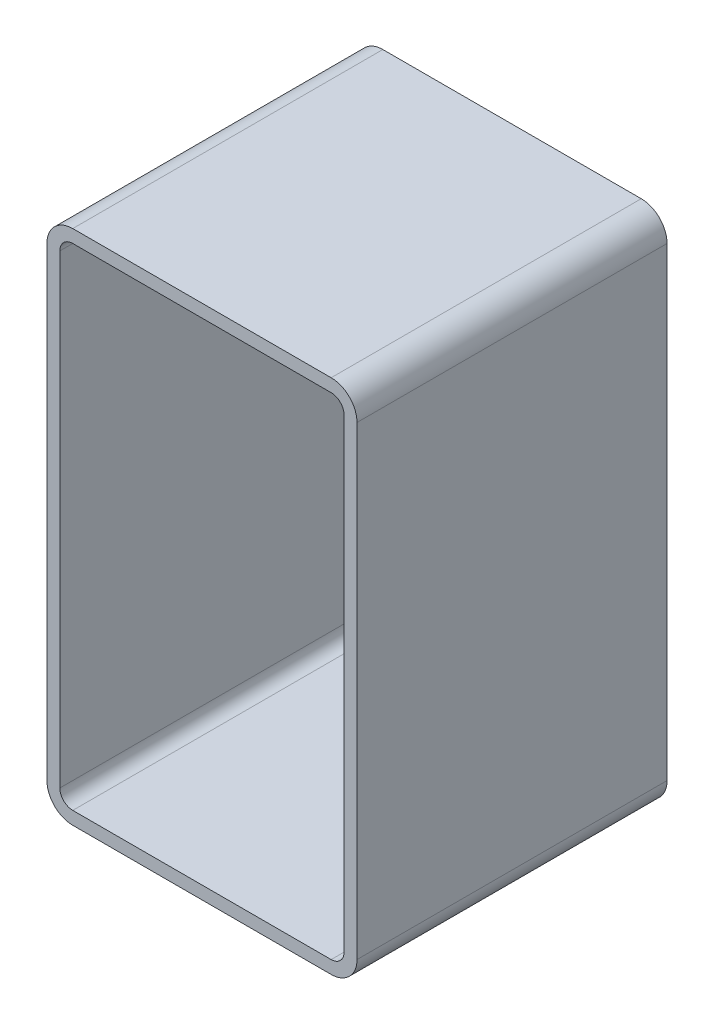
ISO-10303-21;
HEADER;
FILE_DESCRIPTION(('STEP AP214'),'2;1');
FILE_NAME('part.step','',(''),(''),'','','');
FILE_SCHEMA(('AUTOMOTIVE_DESIGN { 1 0 10303 214 1 1 1 1 }'));
ENDSEC;
DATA;
#1=APPLICATION_CONTEXT('core data for automotive mechanical design processes');
#2=APPLICATION_PROTOCOL_DEFINITION('international standard','automotive_design',2000,#1);
#3=PRODUCT_CONTEXT('',#1,'mechanical');
#4=PRODUCT('Part','Part','',(#3));
#5=PRODUCT_RELATED_PRODUCT_CATEGORY('part','',(#4));
#6=PRODUCT_DEFINITION_FORMATION('','',#4);
#7=PRODUCT_DEFINITION_CONTEXT('part definition',#1,'design');
#8=PRODUCT_DEFINITION('design','',#6,#7);
#9=PRODUCT_DEFINITION_SHAPE('','',#8);
#10=(LENGTH_UNIT() NAMED_UNIT(*) SI_UNIT(.MILLI.,.METRE.));
#11=(NAMED_UNIT(*) PLANE_ANGLE_UNIT() SI_UNIT($,.RADIAN.));
#12=(NAMED_UNIT(*) SI_UNIT($,.STERADIAN.) SOLID_ANGLE_UNIT());
#13=UNCERTAINTY_MEASURE_WITH_UNIT(LENGTH_MEASURE(1.E-05),#10,'distance_accuracy_value','');
#14=(GEOMETRIC_REPRESENTATION_CONTEXT(3) GLOBAL_UNCERTAINTY_ASSIGNED_CONTEXT((#13)) GLOBAL_UNIT_ASSIGNED_CONTEXT((#10,
#11,#12)) REPRESENTATION_CONTEXT('',''));
#15=CARTESIAN_POINT('',(0.,0.,0.));
#16=DIRECTION('',(0.,0.,1.));
#17=DIRECTION('',(1.,0.,0.));
#18=AXIS2_PLACEMENT_3D('',#15,#16,#17);
#19=CARTESIAN_POINT('',(280.50670300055,27.0912282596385,304.8));
#20=DIRECTION('',(0.,0.,1.));
#21=DIRECTION('',(1.,0.,0.));
#22=AXIS2_PLACEMENT_3D('',#19,#20,#21);
#23=PLANE('',#22);
#24=CARTESIAN_POINT('',(280.50670300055,27.0912282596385,304.8));
#25=DIRECTION('',(0.,0.,1.));
#26=DIRECTION('',(1.,0.,0.));
#27=AXIS2_PLACEMENT_3D('',#24,#25,#26);
#28=CIRCLE('',#27,25.4);
#29=CARTESIAN_POINT('',(280.50670300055,1.6912282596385,304.8));
#30=VERTEX_POINT('',#29);
#31=CARTESIAN_POINT('',(305.90670300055,27.0912282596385,304.8));
#32=VERTEX_POINT('',#31);
#33=EDGE_CURVE('E211',#30,#32,#28,.T.);
#34=ORIENTED_EDGE('',*,*,#33,.T.);
#35=DIRECTION('',(0.,1.,0.));
#36=VECTOR('',#35,1.);
#37=CARTESIAN_POINT('',(305.90670300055,484.291228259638,304.8));
#38=LINE('',#37,#36);
#39=CARTESIAN_POINT('',(305.90670300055,484.291228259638,304.8));
#40=VERTEX_POINT('',#39);
#41=EDGE_CURVE('E214',#32,#40,#38,.T.);
#42=ORIENTED_EDGE('',*,*,#41,.T.);
#43=CARTESIAN_POINT('',(280.50670300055,484.291228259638,304.8));
#44=DIRECTION('',(0.,0.,1.));
#45=DIRECTION('',(1.,0.,0.));
#46=AXIS2_PLACEMENT_3D('',#43,#44,#45);
#47=CIRCLE('',#46,25.4);
#48=CARTESIAN_POINT('',(280.50670300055,509.691228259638,304.8));
#49=VERTEX_POINT('',#48);
#50=EDGE_CURVE('E217',#40,#49,#47,.T.);
#51=ORIENTED_EDGE('',*,*,#50,.T.);
#52=DIRECTION('',(-1.,0.,0.));
#53=VECTOR('',#52,1.);
#54=CARTESIAN_POINT('',(26.5067030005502,509.691228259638,304.8));
#55=LINE('',#54,#53);
#56=CARTESIAN_POINT('',(26.5067030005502,509.691228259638,304.8));
#57=VERTEX_POINT('',#56);
#58=EDGE_CURVE('E219',#49,#57,#55,.T.);
#59=ORIENTED_EDGE('',*,*,#58,.T.);
#60=CARTESIAN_POINT('',(26.5067030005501,484.291228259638,304.8));
#61=DIRECTION('',(0.,0.,1.));
#62=DIRECTION('',(1.,0.,0.));
#63=AXIS2_PLACEMENT_3D('',#60,#61,#62);
#64=CIRCLE('',#63,25.4);
#65=CARTESIAN_POINT('',(1.10670300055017,484.291228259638,304.8));
#66=VERTEX_POINT('',#65);
#67=EDGE_CURVE('E221',#57,#66,#64,.T.);
#68=ORIENTED_EDGE('',*,*,#67,.T.);
#69=DIRECTION('',(0.,-1.,0.));
#70=VECTOR('',#69,1.);
#71=CARTESIAN_POINT('',(1.10670300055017,27.0912282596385,304.8));
#72=LINE('',#71,#70);
#73=CARTESIAN_POINT('',(1.10670300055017,27.0912282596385,304.8));
#74=VERTEX_POINT('',#73);
#75=EDGE_CURVE('E223',#66,#74,#72,.T.);
#76=ORIENTED_EDGE('',*,*,#75,.T.);
#77=CARTESIAN_POINT('',(26.5067030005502,27.0912282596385,304.8));
#78=DIRECTION('',(0.,0.,1.));
#79=DIRECTION('',(1.,0.,0.));
#80=AXIS2_PLACEMENT_3D('',#77,#78,#79);
#81=CIRCLE('',#80,25.4);
#82=CARTESIAN_POINT('',(26.5067030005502,1.6912282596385,304.8));
#83=VERTEX_POINT('',#82);
#84=EDGE_CURVE('E225',#74,#83,#81,.T.);
#85=ORIENTED_EDGE('',*,*,#84,.T.);
#86=DIRECTION('',(1.,0.,0.));
#87=VECTOR('',#86,1.);
#88=CARTESIAN_POINT('',(280.50670300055,1.6912282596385,304.8));
#89=LINE('',#88,#87);
#90=EDGE_CURVE('E227',#83,#30,#89,.T.);
#91=ORIENTED_EDGE('',*,*,#90,.T.);
#92=EDGE_LOOP('',(#34,#42,#51,#59,#68,#76,#85,#91));
#93=FACE_BOUND('',#92,.T.);
#94=DIRECTION('',(0.,-1.,0.));
#95=VECTOR('',#94,1.);
#96=CARTESIAN_POINT('',(13.8067030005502,27.0912282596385,304.8));
#97=LINE('',#96,#95);
#98=CARTESIAN_POINT('',(13.8067030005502,484.291228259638,304.8));
#99=VERTEX_POINT('',#98);
#100=CARTESIAN_POINT('',(13.8067030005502,27.0912282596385,304.8));
#101=VERTEX_POINT('',#100);
#102=EDGE_CURVE('E154',#99,#101,#97,.T.);
#103=ORIENTED_EDGE('',*,*,#102,.F.);
#104=CARTESIAN_POINT('',(26.5067030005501,484.291228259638,304.8));
#105=DIRECTION('',(0.,0.,1.));
#106=DIRECTION('',(1.,0.,0.));
#107=AXIS2_PLACEMENT_3D('',#104,#105,#106);
#108=CIRCLE('',#107,12.7);
#109=CARTESIAN_POINT('',(26.5067030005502,496.991228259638,304.8));
#110=VERTEX_POINT('',#109);
#111=EDGE_CURVE('E146',#110,#99,#108,.T.);
#112=ORIENTED_EDGE('',*,*,#111,.F.);
#113=DIRECTION('',(-1.,0.,0.));
#114=VECTOR('',#113,1.);
#115=CARTESIAN_POINT('',(26.5067030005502,496.991228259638,304.8));
#116=LINE('',#115,#114);
#117=CARTESIAN_POINT('',(280.50670300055,496.991228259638,304.8));
#118=VERTEX_POINT('',#117);
#119=EDGE_CURVE('E179',#118,#110,#116,.T.);
#120=ORIENTED_EDGE('',*,*,#119,.F.);
#121=CARTESIAN_POINT('',(280.50670300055,484.291228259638,304.8));
#122=DIRECTION('',(0.,0.,1.));
#123=DIRECTION('',(1.,0.,0.));
#124=AXIS2_PLACEMENT_3D('',#121,#122,#123);
#125=CIRCLE('',#124,12.7);
#126=CARTESIAN_POINT('',(293.20670300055,484.291228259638,304.8));
#127=VERTEX_POINT('',#126);
#128=EDGE_CURVE('E177',#127,#118,#125,.T.);
#129=ORIENTED_EDGE('',*,*,#128,.F.);
#130=DIRECTION('',(0.,1.,0.));
#131=VECTOR('',#130,1.);
#132=CARTESIAN_POINT('',(293.20670300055,484.291228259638,304.8));
#133=LINE('',#132,#131);
#134=CARTESIAN_POINT('',(293.20670300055,27.0912282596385,304.8));
#135=VERTEX_POINT('',#134);
#136=EDGE_CURVE('E175',#135,#127,#133,.T.);
#137=ORIENTED_EDGE('',*,*,#136,.F.);
#138=CARTESIAN_POINT('',(280.50670300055,27.0912282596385,304.8));
#139=DIRECTION('',(0.,0.,1.));
#140=DIRECTION('',(1.,0.,0.));
#141=AXIS2_PLACEMENT_3D('',#138,#139,#140);
#142=CIRCLE('',#141,12.7);
#143=CARTESIAN_POINT('',(280.50670300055,14.3912282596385,304.8));
#144=VERTEX_POINT('',#143);
#145=EDGE_CURVE('E173',#144,#135,#142,.T.);
#146=ORIENTED_EDGE('',*,*,#145,.F.);
#147=DIRECTION('',(1.,0.,0.));
#148=VECTOR('',#147,1.);
#149=CARTESIAN_POINT('',(280.50670300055,14.3912282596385,304.8));
#150=LINE('',#149,#148);
#151=CARTESIAN_POINT('',(26.5067030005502,14.3912282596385,304.8));
#152=VERTEX_POINT('',#151);
#153=EDGE_CURVE('E169',#152,#144,#150,.T.);
#154=ORIENTED_EDGE('',*,*,#153,.F.);
#155=CARTESIAN_POINT('',(26.5067030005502,27.0912282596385,304.8));
#156=DIRECTION('',(0.,0.,1.));
#157=DIRECTION('',(1.,0.,0.));
#158=AXIS2_PLACEMENT_3D('',#155,#156,#157);
#159=CIRCLE('',#158,12.7);
#160=EDGE_CURVE('E167',#101,#152,#159,.T.);
#161=ORIENTED_EDGE('',*,*,#160,.F.);
#162=EDGE_LOOP('',(#103,#112,#120,#129,#137,#146,#154,#161));
#163=FACE_BOUND('',#162,.T.);
#164=ADVANCED_FACE('F33',(#93,#163),#23,.T.);
#165=CARTESIAN_POINT('',(280.50670300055,27.0912282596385,0.));
#166=DIRECTION('',(0.,0.,1.));
#167=DIRECTION('',(1.,0.,0.));
#168=AXIS2_PLACEMENT_3D('',#165,#166,#167);
#169=PLANE('',#168);
#170=CARTESIAN_POINT('',(280.50670300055,27.0912282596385,0.));
#171=DIRECTION('',(0.,0.,1.));
#172=DIRECTION('',(1.,0.,0.));
#173=AXIS2_PLACEMENT_3D('',#170,#171,#172);
#174=CIRCLE('',#173,25.4);
#175=CARTESIAN_POINT('',(280.50670300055,1.6912282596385,0.));
#176=VERTEX_POINT('',#175);
#177=CARTESIAN_POINT('',(305.90670300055,27.0912282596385,0.));
#178=VERTEX_POINT('',#177);
#179=EDGE_CURVE('E162',#176,#178,#174,.T.);
#180=ORIENTED_EDGE('',*,*,#179,.F.);
#181=DIRECTION('',(1.,0.,0.));
#182=VECTOR('',#181,1.);
#183=CARTESIAN_POINT('',(280.50670300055,1.6912282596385,0.));
#184=LINE('',#183,#182);
#185=CARTESIAN_POINT('',(26.5067030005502,1.6912282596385,0.));
#186=VERTEX_POINT('',#185);
#187=EDGE_CURVE('E215',#186,#176,#184,.T.);
#188=ORIENTED_EDGE('',*,*,#187,.F.);
#189=CARTESIAN_POINT('',(26.5067030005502,27.0912282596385,0.));
#190=DIRECTION('',(0.,0.,1.));
#191=DIRECTION('',(1.,0.,0.));
#192=AXIS2_PLACEMENT_3D('',#189,#190,#191);
#193=CIRCLE('',#192,25.4);
#194=CARTESIAN_POINT('',(1.10670300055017,27.0912282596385,0.));
#195=VERTEX_POINT('',#194);
#196=EDGE_CURVE('E242',#195,#186,#193,.T.);
#197=ORIENTED_EDGE('',*,*,#196,.F.);
#198=DIRECTION('',(0.,-1.,0.));
#199=VECTOR('',#198,1.);
#200=CARTESIAN_POINT('',(1.10670300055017,27.0912282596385,0.));
#201=LINE('',#200,#199);
#202=CARTESIAN_POINT('',(1.10670300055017,484.291228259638,0.));
#203=VERTEX_POINT('',#202);
#204=EDGE_CURVE('E240',#203,#195,#201,.T.);
#205=ORIENTED_EDGE('',*,*,#204,.F.);
#206=CARTESIAN_POINT('',(26.5067030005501,484.291228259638,0.));
#207=DIRECTION('',(0.,0.,1.));
#208=DIRECTION('',(1.,0.,0.));
#209=AXIS2_PLACEMENT_3D('',#206,#207,#208);
#210=CIRCLE('',#209,25.4);
#211=CARTESIAN_POINT('',(26.5067030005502,509.691228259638,0.));
#212=VERTEX_POINT('',#211);
#213=EDGE_CURVE('E238',#212,#203,#210,.T.);
#214=ORIENTED_EDGE('',*,*,#213,.F.);
#215=DIRECTION('',(-1.,0.,0.));
#216=VECTOR('',#215,1.);
#217=CARTESIAN_POINT('',(26.5067030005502,509.691228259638,0.));
#218=LINE('',#217,#216);
#219=CARTESIAN_POINT('',(280.50670300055,509.691228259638,0.));
#220=VERTEX_POINT('',#219);
#221=EDGE_CURVE('E236',#220,#212,#218,.T.);
#222=ORIENTED_EDGE('',*,*,#221,.F.);
#223=CARTESIAN_POINT('',(280.50670300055,484.291228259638,0.));
#224=DIRECTION('',(0.,0.,1.));
#225=DIRECTION('',(1.,0.,0.));
#226=AXIS2_PLACEMENT_3D('',#223,#224,#225);
#227=CIRCLE('',#226,25.4);
#228=CARTESIAN_POINT('',(305.90670300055,484.291228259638,0.));
#229=VERTEX_POINT('',#228);
#230=EDGE_CURVE('E234',#229,#220,#227,.T.);
#231=ORIENTED_EDGE('',*,*,#230,.F.);
#232=DIRECTION('',(0.,1.,0.));
#233=VECTOR('',#232,1.);
#234=CARTESIAN_POINT('',(305.90670300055,484.291228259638,0.));
#235=LINE('',#234,#233);
#236=EDGE_CURVE('E232',#178,#229,#235,.T.);
#237=ORIENTED_EDGE('',*,*,#236,.F.);
#238=EDGE_LOOP('',(#180,#188,#197,#205,#214,#222,#231,#237));
#239=FACE_BOUND('',#238,.T.);
#240=CARTESIAN_POINT('',(26.5067030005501,484.291228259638,0.));
#241=DIRECTION('',(0.,0.,1.));
#242=DIRECTION('',(1.,0.,0.));
#243=AXIS2_PLACEMENT_3D('',#240,#241,#242);
#244=CIRCLE('',#243,12.7);
#245=CARTESIAN_POINT('',(26.5067030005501,496.991228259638,0.));
#246=VERTEX_POINT('',#245);
#247=CARTESIAN_POINT('',(13.8067030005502,484.291228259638,0.));
#248=VERTEX_POINT('',#247);
#249=EDGE_CURVE('E56',#246,#248,#244,.T.);
#250=ORIENTED_EDGE('',*,*,#249,.T.);
#251=DIRECTION('',(0.,-1.,0.));
#252=VECTOR('',#251,1.);
#253=CARTESIAN_POINT('',(13.8067030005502,27.0912282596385,0.));
#254=LINE('',#253,#252);
#255=CARTESIAN_POINT('',(13.8067030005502,27.0912282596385,0.));
#256=VERTEX_POINT('',#255);
#257=EDGE_CURVE('E161',#248,#256,#254,.T.);
#258=ORIENTED_EDGE('',*,*,#257,.T.);
#259=CARTESIAN_POINT('',(26.5067030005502,27.0912282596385,0.));
#260=DIRECTION('',(0.,0.,1.));
#261=DIRECTION('',(1.,0.,0.));
#262=AXIS2_PLACEMENT_3D('',#259,#260,#261);
#263=CIRCLE('',#262,12.7);
#264=CARTESIAN_POINT('',(26.5067030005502,14.3912282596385,0.));
#265=VERTEX_POINT('',#264);
#266=EDGE_CURVE('E183',#256,#265,#263,.T.);
#267=ORIENTED_EDGE('',*,*,#266,.T.);
#268=DIRECTION('',(1.,0.,0.));
#269=VECTOR('',#268,1.);
#270=CARTESIAN_POINT('',(280.50670300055,14.3912282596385,0.));
#271=LINE('',#270,#269);
#272=CARTESIAN_POINT('',(280.50670300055,14.3912282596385,0.));
#273=VERTEX_POINT('',#272);
#274=EDGE_CURVE('E186',#265,#273,#271,.T.);
#275=ORIENTED_EDGE('',*,*,#274,.T.);
#276=CARTESIAN_POINT('',(280.50670300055,27.0912282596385,0.));
#277=DIRECTION('',(0.,0.,1.));
#278=DIRECTION('',(1.,0.,0.));
#279=AXIS2_PLACEMENT_3D('',#276,#277,#278);
#280=CIRCLE('',#279,12.7);
#281=CARTESIAN_POINT('',(293.20670300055,27.0912282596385,0.));
#282=VERTEX_POINT('',#281);
#283=EDGE_CURVE('E189',#273,#282,#280,.T.);
#284=ORIENTED_EDGE('',*,*,#283,.T.);
#285=DIRECTION('',(0.,1.,0.));
#286=VECTOR('',#285,1.);
#287=CARTESIAN_POINT('',(293.20670300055,484.291228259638,0.));
#288=LINE('',#287,#286);
#289=CARTESIAN_POINT('',(293.20670300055,484.291228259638,0.));
#290=VERTEX_POINT('',#289);
#291=EDGE_CURVE('E192',#282,#290,#288,.T.);
#292=ORIENTED_EDGE('',*,*,#291,.T.);
#293=CARTESIAN_POINT('',(280.50670300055,484.291228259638,0.));
#294=DIRECTION('',(0.,0.,1.));
#295=DIRECTION('',(1.,0.,0.));
#296=AXIS2_PLACEMENT_3D('',#293,#294,#295);
#297=CIRCLE('',#296,12.7);
#298=CARTESIAN_POINT('',(280.50670300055,496.991228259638,0.));
#299=VERTEX_POINT('',#298);
#300=EDGE_CURVE('E195',#290,#299,#297,.T.);
#301=ORIENTED_EDGE('',*,*,#300,.T.);
#302=DIRECTION('',(-1.,0.,0.));
#303=VECTOR('',#302,1.);
#304=CARTESIAN_POINT('',(26.5067030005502,496.991228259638,0.));
#305=LINE('',#304,#303);
#306=EDGE_CURVE('E155',#299,#246,#305,.T.);
#307=ORIENTED_EDGE('',*,*,#306,.T.);
#308=EDGE_LOOP('',(#250,#258,#267,#275,#284,#292,#301,#307));
#309=FACE_BOUND('',#308,.T.);
#310=ADVANCED_FACE('F272',(#239,#309),#169,.F.);
#311=CARTESIAN_POINT('',(280.50670300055,27.0912282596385,304.8));
#312=DIRECTION('',(0.,0.,-1.));
#313=DIRECTION('',(-1.,0.,0.));
#314=AXIS2_PLACEMENT_3D('',#311,#312,#313);
#315=CYLINDRICAL_SURFACE('',#314,25.4);
#316=ORIENTED_EDGE('',*,*,#179,.T.);
#317=DIRECTION('',(0.,0.,-1.));
#318=VECTOR('',#317,1.);
#319=CARTESIAN_POINT('',(305.90670300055,27.0912282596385,304.8));
#320=LINE('',#319,#318);
#321=EDGE_CURVE('E11',#32,#178,#320,.T.);
#322=ORIENTED_EDGE('',*,*,#321,.F.);
#323=ORIENTED_EDGE('',*,*,#33,.F.);
#324=DIRECTION('',(0.,0.,-1.));
#325=VECTOR('',#324,1.);
#326=CARTESIAN_POINT('',(280.50670300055,1.6912282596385,304.8));
#327=LINE('',#326,#325);
#328=EDGE_CURVE('E229',#30,#176,#327,.T.);
#329=ORIENTED_EDGE('',*,*,#328,.T.);
#330=EDGE_LOOP('',(#316,#322,#323,#329));
#331=FACE_BOUND('',#330,.T.);
#332=ADVANCED_FACE('F35',(#331),#315,.T.);
#333=CARTESIAN_POINT('',(305.90670300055,484.291228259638,304.8));
#334=DIRECTION('',(-1.,0.,0.));
#335=DIRECTION('',(0.,0.,1.));
#336=AXIS2_PLACEMENT_3D('',#333,#334,#335);
#337=PLANE('',#336);
#338=ORIENTED_EDGE('',*,*,#236,.T.);
#339=DIRECTION('',(0.,0.,-1.));
#340=VECTOR('',#339,1.);
#341=CARTESIAN_POINT('',(305.90670300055,484.291228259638,304.8));
#342=LINE('',#341,#340);
#343=EDGE_CURVE('E41',#40,#229,#342,.T.);
#344=ORIENTED_EDGE('',*,*,#343,.F.);
#345=ORIENTED_EDGE('',*,*,#41,.F.);
#346=ORIENTED_EDGE('',*,*,#321,.T.);
#347=EDGE_LOOP('',(#338,#344,#345,#346));
#348=FACE_BOUND('',#347,.T.);
#349=ADVANCED_FACE('F289',(#348),#337,.F.);
#350=CARTESIAN_POINT('',(280.50670300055,484.291228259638,304.8));
#351=DIRECTION('',(0.,0.,-1.));
#352=DIRECTION('',(-1.,0.,0.));
#353=AXIS2_PLACEMENT_3D('',#350,#351,#352);
#354=CYLINDRICAL_SURFACE('',#353,25.4);
#355=ORIENTED_EDGE('',*,*,#230,.T.);
#356=DIRECTION('',(0.,0.,-1.));
#357=VECTOR('',#356,1.);
#358=CARTESIAN_POINT('',(280.50670300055,509.691228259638,304.8));
#359=LINE('',#358,#357);
#360=EDGE_CURVE('E259',#49,#220,#359,.T.);
#361=ORIENTED_EDGE('',*,*,#360,.F.);
#362=ORIENTED_EDGE('',*,*,#50,.F.);
#363=ORIENTED_EDGE('',*,*,#343,.T.);
#364=EDGE_LOOP('',(#355,#361,#362,#363));
#365=FACE_BOUND('',#364,.T.);
#366=ADVANCED_FACE('F266',(#365),#354,.T.);
#367=CARTESIAN_POINT('',(26.5067030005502,509.691228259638,304.8));
#368=DIRECTION('',(0.,-1.,0.));
#369=DIRECTION('',(0.,0.,-1.));
#370=AXIS2_PLACEMENT_3D('',#367,#368,#369);
#371=PLANE('',#370);
#372=ORIENTED_EDGE('',*,*,#221,.T.);
#373=DIRECTION('',(0.,0.,-1.));
#374=VECTOR('',#373,1.);
#375=CARTESIAN_POINT('',(26.5067030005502,509.691228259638,304.8));
#376=LINE('',#375,#374);
#377=EDGE_CURVE('E256',#57,#212,#376,.T.);
#378=ORIENTED_EDGE('',*,*,#377,.F.);
#379=ORIENTED_EDGE('',*,*,#58,.F.);
#380=ORIENTED_EDGE('',*,*,#360,.T.);
#381=EDGE_LOOP('',(#372,#378,#379,#380));
#382=FACE_BOUND('',#381,.T.);
#383=ADVANCED_FACE('F278',(#382),#371,.F.);
#384=CARTESIAN_POINT('',(26.5067030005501,484.291228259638,304.8));
#385=DIRECTION('',(0.,0.,-1.));
#386=DIRECTION('',(-1.,0.,0.));
#387=AXIS2_PLACEMENT_3D('',#384,#385,#386);
#388=CYLINDRICAL_SURFACE('',#387,25.4);
#389=ORIENTED_EDGE('',*,*,#213,.T.);
#390=DIRECTION('',(0.,0.,-1.));
#391=VECTOR('',#390,1.);
#392=CARTESIAN_POINT('',(1.10670300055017,484.291228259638,304.8));
#393=LINE('',#392,#391);
#394=EDGE_CURVE('E253',#66,#203,#393,.T.);
#395=ORIENTED_EDGE('',*,*,#394,.F.);
#396=ORIENTED_EDGE('',*,*,#67,.F.);
#397=ORIENTED_EDGE('',*,*,#377,.T.);
#398=EDGE_LOOP('',(#389,#395,#396,#397));
#399=FACE_BOUND('',#398,.T.);
#400=ADVANCED_FACE('F282',(#399),#388,.T.);
#401=CARTESIAN_POINT('',(1.10670300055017,27.0912282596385,304.8));
#402=DIRECTION('',(1.,0.,0.));
#403=DIRECTION('',(0.,0.,-1.));
#404=AXIS2_PLACEMENT_3D('',#401,#402,#403);
#405=PLANE('',#404);
#406=ORIENTED_EDGE('',*,*,#204,.T.);
#407=DIRECTION('',(0.,0.,-1.));
#408=VECTOR('',#407,1.);
#409=CARTESIAN_POINT('',(1.10670300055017,27.0912282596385,304.8));
#410=LINE('',#409,#408);
#411=EDGE_CURVE('E250',#74,#195,#410,.T.);
#412=ORIENTED_EDGE('',*,*,#411,.F.);
#413=ORIENTED_EDGE('',*,*,#75,.F.);
#414=ORIENTED_EDGE('',*,*,#394,.T.);
#415=EDGE_LOOP('',(#406,#412,#413,#414));
#416=FACE_BOUND('',#415,.T.);
#417=ADVANCED_FACE('F302',(#416),#405,.F.);
#418=CARTESIAN_POINT('',(26.5067030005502,27.0912282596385,304.8));
#419=DIRECTION('',(0.,0.,-1.));
#420=DIRECTION('',(-1.,0.,0.));
#421=AXIS2_PLACEMENT_3D('',#418,#419,#420);
#422=CYLINDRICAL_SURFACE('',#421,25.4);
#423=ORIENTED_EDGE('',*,*,#196,.T.);
#424=DIRECTION('',(0.,0.,-1.));
#425=VECTOR('',#424,1.);
#426=CARTESIAN_POINT('',(26.5067030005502,1.6912282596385,304.8));
#427=LINE('',#426,#425);
#428=EDGE_CURVE('E247',#83,#186,#427,.T.);
#429=ORIENTED_EDGE('',*,*,#428,.F.);
#430=ORIENTED_EDGE('',*,*,#84,.F.);
#431=ORIENTED_EDGE('',*,*,#411,.T.);
#432=EDGE_LOOP('',(#423,#429,#430,#431));
#433=FACE_BOUND('',#432,.T.);
#434=ADVANCED_FACE('F300',(#433),#422,.T.);
#435=CARTESIAN_POINT('',(280.50670300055,1.6912282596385,304.8));
#436=DIRECTION('',(0.,1.,0.));
#437=DIRECTION('',(0.,0.,1.));
#438=AXIS2_PLACEMENT_3D('',#435,#436,#437);
#439=PLANE('',#438);
#440=ORIENTED_EDGE('',*,*,#187,.T.);
#441=ORIENTED_EDGE('',*,*,#328,.F.);
#442=ORIENTED_EDGE('',*,*,#90,.F.);
#443=ORIENTED_EDGE('',*,*,#428,.T.);
#444=EDGE_LOOP('',(#440,#441,#442,#443));
#445=FACE_BOUND('',#444,.T.);
#446=ADVANCED_FACE('F295',(#445),#439,.F.);
#447=CARTESIAN_POINT('',(26.5067030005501,484.291228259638,304.8));
#448=DIRECTION('',(0.,0.,-1.));
#449=DIRECTION('',(-1.,0.,0.));
#450=AXIS2_PLACEMENT_3D('',#447,#448,#449);
#451=CYLINDRICAL_SURFACE('',#450,12.7);
#452=ORIENTED_EDGE('',*,*,#249,.F.);
#453=DIRECTION('',(0.,0.,-1.));
#454=VECTOR('',#453,1.);
#455=CARTESIAN_POINT('',(26.5067030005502,496.991228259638,304.8));
#456=LINE('',#455,#454);
#457=EDGE_CURVE('E150',#110,#246,#456,.T.);
#458=ORIENTED_EDGE('',*,*,#457,.F.);
#459=ORIENTED_EDGE('',*,*,#111,.T.);
#460=DIRECTION('',(0.,0.,-1.));
#461=VECTOR('',#460,1.);
#462=CARTESIAN_POINT('',(13.8067030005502,484.291228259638,304.8));
#463=LINE('',#462,#461);
#464=EDGE_CURVE('E149',#99,#248,#463,.T.);
#465=ORIENTED_EDGE('',*,*,#464,.T.);
#466=EDGE_LOOP('',(#452,#458,#459,#465));
#467=FACE_BOUND('',#466,.T.);
#468=ADVANCED_FACE('F148',(#467),#451,.F.);
#469=CARTESIAN_POINT('',(13.8067030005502,27.0912282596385,304.8));
#470=DIRECTION('',(1.,0.,0.));
#471=DIRECTION('',(0.,0.,-1.));
#472=AXIS2_PLACEMENT_3D('',#469,#470,#471);
#473=PLANE('',#472);
#474=ORIENTED_EDGE('',*,*,#257,.F.);
#475=ORIENTED_EDGE('',*,*,#464,.F.);
#476=ORIENTED_EDGE('',*,*,#102,.T.);
#477=DIRECTION('',(0.,0.,-1.));
#478=VECTOR('',#477,1.);
#479=CARTESIAN_POINT('',(13.8067030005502,27.0912282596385,304.8));
#480=LINE('',#479,#478);
#481=EDGE_CURVE('E163',#101,#256,#480,.T.);
#482=ORIENTED_EDGE('',*,*,#481,.T.);
#483=EDGE_LOOP('',(#474,#475,#476,#482));
#484=FACE_BOUND('',#483,.T.);
#485=ADVANCED_FACE('F158',(#484),#473,.T.);
#486=CARTESIAN_POINT('',(26.5067030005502,27.0912282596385,304.8));
#487=DIRECTION('',(0.,0.,-1.));
#488=DIRECTION('',(-1.,0.,0.));
#489=AXIS2_PLACEMENT_3D('',#486,#487,#488);
#490=CYLINDRICAL_SURFACE('',#489,12.7);
#491=ORIENTED_EDGE('',*,*,#266,.F.);
#492=ORIENTED_EDGE('',*,*,#481,.F.);
#493=ORIENTED_EDGE('',*,*,#160,.T.);
#494=DIRECTION('',(0.,0.,-1.));
#495=VECTOR('',#494,1.);
#496=CARTESIAN_POINT('',(26.5067030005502,14.3912282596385,304.8));
#497=LINE('',#496,#495);
#498=EDGE_CURVE('E208',#152,#265,#497,.T.);
#499=ORIENTED_EDGE('',*,*,#498,.T.);
#500=EDGE_LOOP('',(#491,#492,#493,#499));
#501=FACE_BOUND('',#500,.T.);
#502=ADVANCED_FACE('F327',(#501),#490,.F.);
#503=CARTESIAN_POINT('',(280.50670300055,14.3912282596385,304.8));
#504=DIRECTION('',(0.,1.,0.));
#505=DIRECTION('',(0.,0.,1.));
#506=AXIS2_PLACEMENT_3D('',#503,#504,#505);
#507=PLANE('',#506);
#508=ORIENTED_EDGE('',*,*,#274,.F.);
#509=ORIENTED_EDGE('',*,*,#498,.F.);
#510=ORIENTED_EDGE('',*,*,#153,.T.);
#511=DIRECTION('',(0.,0.,-1.));
#512=VECTOR('',#511,1.);
#513=CARTESIAN_POINT('',(280.50670300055,14.3912282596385,304.8));
#514=LINE('',#513,#512);
#515=EDGE_CURVE('E206',#144,#273,#514,.T.);
#516=ORIENTED_EDGE('',*,*,#515,.T.);
#517=EDGE_LOOP('',(#508,#509,#510,#516));
#518=FACE_BOUND('',#517,.T.);
#519=ADVANCED_FACE('F331',(#518),#507,.T.);
#520=CARTESIAN_POINT('',(280.50670300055,27.0912282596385,304.8));
#521=DIRECTION('',(0.,0.,-1.));
#522=DIRECTION('',(-1.,0.,0.));
#523=AXIS2_PLACEMENT_3D('',#520,#521,#522);
#524=CYLINDRICAL_SURFACE('',#523,12.7);
#525=ORIENTED_EDGE('',*,*,#283,.F.);
#526=ORIENTED_EDGE('',*,*,#515,.F.);
#527=ORIENTED_EDGE('',*,*,#145,.T.);
#528=DIRECTION('',(0.,0.,-1.));
#529=VECTOR('',#528,1.);
#530=CARTESIAN_POINT('',(293.20670300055,27.0912282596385,304.8));
#531=LINE('',#530,#529);
#532=EDGE_CURVE('E204',#135,#282,#531,.T.);
#533=ORIENTED_EDGE('',*,*,#532,.T.);
#534=EDGE_LOOP('',(#525,#526,#527,#533));
#535=FACE_BOUND('',#534,.T.);
#536=ADVANCED_FACE('F337',(#535),#524,.F.);
#537=CARTESIAN_POINT('',(293.20670300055,484.291228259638,304.8));
#538=DIRECTION('',(-1.,0.,0.));
#539=DIRECTION('',(0.,0.,1.));
#540=AXIS2_PLACEMENT_3D('',#537,#538,#539);
#541=PLANE('',#540);
#542=ORIENTED_EDGE('',*,*,#291,.F.);
#543=ORIENTED_EDGE('',*,*,#532,.F.);
#544=ORIENTED_EDGE('',*,*,#136,.T.);
#545=DIRECTION('',(0.,0.,-1.));
#546=VECTOR('',#545,1.);
#547=CARTESIAN_POINT('',(293.20670300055,484.291228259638,304.8));
#548=LINE('',#547,#546);
#549=EDGE_CURVE('E202',#127,#290,#548,.T.);
#550=ORIENTED_EDGE('',*,*,#549,.T.);
#551=EDGE_LOOP('',(#542,#543,#544,#550));
#552=FACE_BOUND('',#551,.T.);
#553=ADVANCED_FACE('F341',(#552),#541,.T.);
#554=CARTESIAN_POINT('',(280.50670300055,484.291228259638,304.8));
#555=DIRECTION('',(0.,0.,-1.));
#556=DIRECTION('',(-1.,0.,0.));
#557=AXIS2_PLACEMENT_3D('',#554,#555,#556);
#558=CYLINDRICAL_SURFACE('',#557,12.7);
#559=ORIENTED_EDGE('',*,*,#300,.F.);
#560=ORIENTED_EDGE('',*,*,#549,.F.);
#561=ORIENTED_EDGE('',*,*,#128,.T.);
#562=DIRECTION('',(0.,0.,-1.));
#563=VECTOR('',#562,1.);
#564=CARTESIAN_POINT('',(280.50670300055,496.991228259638,304.8));
#565=LINE('',#564,#563);
#566=EDGE_CURVE('E48',#118,#299,#565,.T.);
#567=ORIENTED_EDGE('',*,*,#566,.T.);
#568=EDGE_LOOP('',(#559,#560,#561,#567));
#569=FACE_BOUND('',#568,.T.);
#570=ADVANCED_FACE('F345',(#569),#558,.F.);
#571=CARTESIAN_POINT('',(26.5067030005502,496.991228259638,304.8));
#572=DIRECTION('',(0.,-1.,0.));
#573=DIRECTION('',(0.,0.,-1.));
#574=AXIS2_PLACEMENT_3D('',#571,#572,#573);
#575=PLANE('',#574);
#576=ORIENTED_EDGE('',*,*,#306,.F.);
#577=ORIENTED_EDGE('',*,*,#566,.F.);
#578=ORIENTED_EDGE('',*,*,#119,.T.);
#579=ORIENTED_EDGE('',*,*,#457,.T.);
#580=EDGE_LOOP('',(#576,#577,#578,#579));
#581=FACE_BOUND('',#580,.T.);
#582=ADVANCED_FACE('F349',(#581),#575,.T.);
#583=CLOSED_SHELL('',(#164,#310,#332,#349,#366,#383,#400,#417,#434,#446,#468,#485,#502,#519,
#536,#553,#570,#582));
#584=MANIFOLD_SOLID_BREP('B2',#583);
#585=ADVANCED_BREP_SHAPE_REPRESENTATION('',(#18,#584),#14);
#586=SHAPE_DEFINITION_REPRESENTATION(#9,#585);
ENDSEC;
END-ISO-10303-21;
